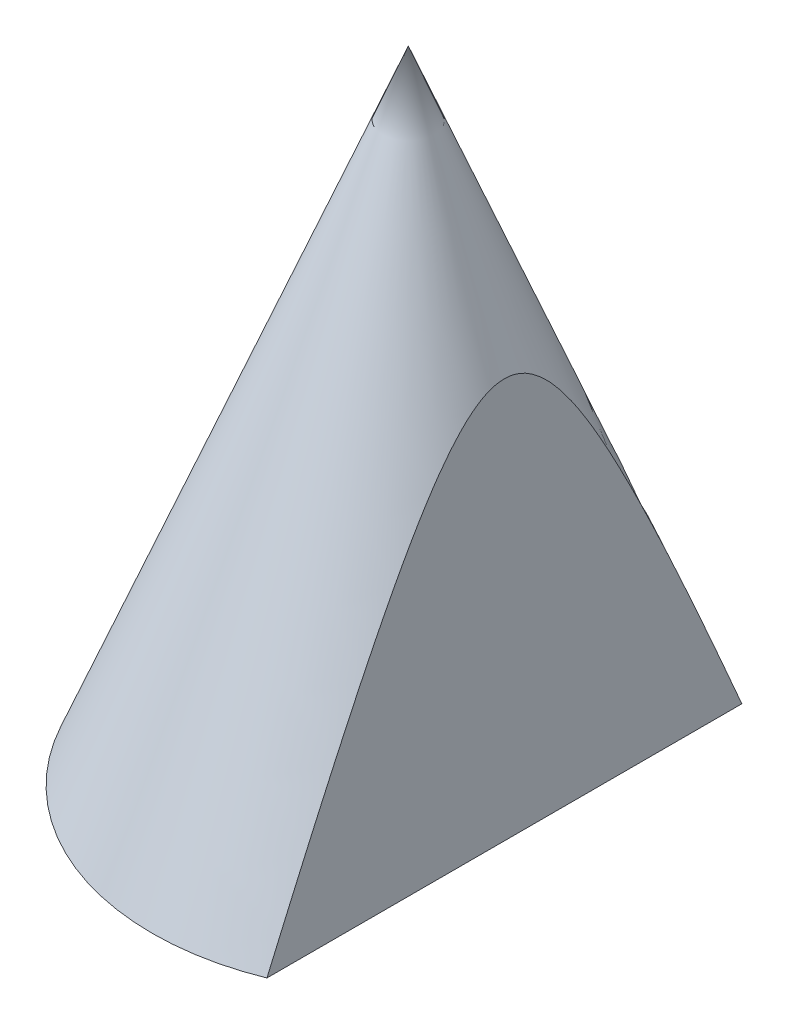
ISO-10303-21;
HEADER;
FILE_DESCRIPTION(('STEP AP214'),'2;1');
FILE_NAME('part.step','',(''),(''),'','','');
FILE_SCHEMA(('AUTOMOTIVE_DESIGN { 1 0 10303 214 1 1 1 1 }'));
ENDSEC;
DATA;
#1=APPLICATION_CONTEXT('core data for automotive mechanical design processes');
#2=APPLICATION_PROTOCOL_DEFINITION('international standard','automotive_design',2000,#1);
#3=PRODUCT_CONTEXT('',#1,'mechanical');
#4=PRODUCT('Part','Part','',(#3));
#5=PRODUCT_RELATED_PRODUCT_CATEGORY('part','',(#4));
#6=PRODUCT_DEFINITION_FORMATION('','',#4);
#7=PRODUCT_DEFINITION_CONTEXT('part definition',#1,'design');
#8=PRODUCT_DEFINITION('design','',#6,#7);
#9=PRODUCT_DEFINITION_SHAPE('','',#8);
#10=(LENGTH_UNIT() NAMED_UNIT(*) SI_UNIT(.MILLI.,.METRE.));
#11=(NAMED_UNIT(*) PLANE_ANGLE_UNIT() SI_UNIT($,.RADIAN.));
#12=(NAMED_UNIT(*) SI_UNIT($,.STERADIAN.) SOLID_ANGLE_UNIT());
#13=UNCERTAINTY_MEASURE_WITH_UNIT(LENGTH_MEASURE(1.E-05),#10,'distance_accuracy_value','');
#14=(GEOMETRIC_REPRESENTATION_CONTEXT(3) GLOBAL_UNCERTAINTY_ASSIGNED_CONTEXT((#13)) GLOBAL_UNIT_ASSIGNED_CONTEXT((#10,
#11,#12)) REPRESENTATION_CONTEXT('',''));
#15=CARTESIAN_POINT('',(0.,0.,0.));
#16=DIRECTION('',(0.,0.,1.));
#17=DIRECTION('',(1.,0.,0.));
#18=AXIS2_PLACEMENT_3D('',#15,#16,#17);
#19=CARTESIAN_POINT('',(5.99999999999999,48.2186316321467,95.4983443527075));
#20=DIRECTION('',(1.,0.,0.));
#21=DIRECTION('',(0.,1.,0.));
#22=AXIS2_PLACEMENT_3D('',#19,#20,#21);
#23=PLANE('',#22);
#24=DIRECTION('',(0.,0.,1.));
#25=VECTOR('',#24,1.);
#26=CARTESIAN_POINT('',(6.,0.,0.));
#27=LINE('',#26,#25);
#28=CARTESIAN_POINT('',(6.,0.,-14.8323969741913));
#29=VERTEX_POINT('',#28);
#30=CARTESIAN_POINT('',(6.,0.,14.8323969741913));
#31=VERTEX_POINT('',#30);
#32=EDGE_CURVE('E63',#29,#31,#27,.T.);
#33=ORIENTED_EDGE('',*,*,#32,.F.);
#34=CARTESIAN_POINT('',(6.,-16.6395559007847,-21.8468827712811));
#35=CARTESIAN_POINT('',(6.,-15.8190797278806,-21.5065335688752));
#36=CARTESIAN_POINT('',(6.,-14.9987962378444,-21.1657191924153));
#37=CARTESIAN_POINT('',(6.,-13.358684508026,-20.4829900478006));
#38=CARTESIAN_POINT('',(6.,-12.5388562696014,-20.1410752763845));
#39=CARTESIAN_POINT('',(6.,-10.898925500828,-19.4556411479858));
#40=CARTESIAN_POINT('',(6.,-10.0788234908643,-19.1121205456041));
#41=CARTESIAN_POINT('',(6.,-8.43924648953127,-18.4235906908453));
#42=CARTESIAN_POINT('',(6.,-7.61977149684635,-18.0785814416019));
#43=CARTESIAN_POINT('',(6.,-5.96872393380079,-17.381382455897));
#44=CARTESIAN_POINT('',(6.,-5.1371630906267,-17.029164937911));
#45=CARTESIAN_POINT('',(6.,-3.47496452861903,-16.3225586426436));
#46=CARTESIAN_POINT('',(6.,-2.64432680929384,-15.9681698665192));
#47=CARTESIAN_POINT('',(6.,-0.98495981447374,-15.2570957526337));
#48=CARTESIAN_POINT('',(6.,-0.156229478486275,-14.9004128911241));
#49=CARTESIAN_POINT('',(6.,1.49981828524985,-14.1838261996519));
#50=CARTESIAN_POINT('',(6.,2.32713574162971,-13.8239224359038));
#51=CARTESIAN_POINT('',(6.,3.9786271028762,-13.1006851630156));
#52=CARTESIAN_POINT('',(6.,4.80280394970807,-12.7373583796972));
#53=CARTESIAN_POINT('',(6.,6.44894475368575,-12.0055502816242));
#54=CARTESIAN_POINT('',(6.,7.27090853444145,-11.6370685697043));
#55=CARTESIAN_POINT('',(6.,8.91418994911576,-10.8923492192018));
#56=CARTESIAN_POINT('',(6.,9.73549884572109,-10.5160922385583));
#57=CARTESIAN_POINT('',(6.,10.9641862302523,-9.94494257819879));
#58=CARTESIAN_POINT('',(6.,11.3731489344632,-9.75345771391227));
#59=CARTESIAN_POINT('',(6.,12.1898035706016,-9.36779885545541));
#60=CARTESIAN_POINT('',(6.,12.5974955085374,-9.17362487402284));
#61=CARTESIAN_POINT('',(6.,13.4086343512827,-8.78338162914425));
#62=CARTESIAN_POINT('',(6.,13.8120914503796,-8.58733357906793));
#63=CARTESIAN_POINT('',(6.,14.6171345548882,-8.19143743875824));
#64=CARTESIAN_POINT('',(6.,15.0187205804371,-7.99158938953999));
#65=CARTESIAN_POINT('',(6.,15.8199859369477,-7.58702557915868));
#66=CARTESIAN_POINT('',(6.,16.2196627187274,-7.38230475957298));
#67=CARTESIAN_POINT('',(6.,17.015978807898,-6.96707974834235));
#68=CARTESIAN_POINT('',(6.,17.4126183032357,-6.75657591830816));
#69=CARTESIAN_POINT('',(6.,18.1998092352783,-6.32933462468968));
#70=CARTESIAN_POINT('',(5.99999999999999,18.590381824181,-6.11263623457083));
#71=CARTESIAN_POINT('',(5.99999999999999,19.3662570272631,-5.6696841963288));
#72=CARTESIAN_POINT('',(5.99999999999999,19.7515582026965,-5.44342800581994));
#73=CARTESIAN_POINT('',(5.99999999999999,20.3232957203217,-5.0946293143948));
#74=CARTESIAN_POINT('',(5.99999999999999,20.5126711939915,-4.9769044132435));
#75=CARTESIAN_POINT('',(5.99999999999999,20.8890084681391,-4.73766471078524));
#76=CARTESIAN_POINT('',(5.99999999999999,21.0759703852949,-4.61615009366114));
#77=CARTESIAN_POINT('',(5.99999999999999,21.4467958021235,-4.36866424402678));
#78=CARTESIAN_POINT('',(5.99999999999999,21.630660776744,-4.24269522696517));
#79=CARTESIAN_POINT('',(5.99999999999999,21.9945328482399,-3.98532070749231));
#80=CARTESIAN_POINT('',(5.99999999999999,22.1745405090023,-3.85391600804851));
#81=CARTESIAN_POINT('',(5.99999999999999,22.4423569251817,-3.65057752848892));
#82=CARTESIAN_POINT('',(5.99999999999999,22.5320458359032,-3.58111701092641));
#83=CARTESIAN_POINT('',(5.99999999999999,22.7098987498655,-3.44024942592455));
#84=CARTESIAN_POINT('',(5.99999999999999,22.7980626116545,-3.36884217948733));
#85=CARTESIAN_POINT('',(5.99999999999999,22.9726717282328,-3.22379162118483));
#86=CARTESIAN_POINT('',(5.99999999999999,23.0591153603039,-3.15014634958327));
#87=CARTESIAN_POINT('',(5.99999999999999,23.2298537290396,-3.00041271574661));
#88=CARTESIAN_POINT('',(5.99999999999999,23.3141485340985,-2.92432443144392));
#89=CARTESIAN_POINT('',(5.99999999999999,23.5619683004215,-2.69310419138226));
#90=CARTESIAN_POINT('',(5.99999999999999,23.7217682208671,-2.53392213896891));
#91=CARTESIAN_POINT('',(5.99999999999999,24.0264486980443,-2.20194122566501));
#92=CARTESIAN_POINT('',(5.99999999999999,24.1713528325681,-2.02916467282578));
#93=CARTESIAN_POINT('',(5.99999999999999,24.3547547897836,-1.77987928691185));
#94=CARTESIAN_POINT('',(5.99999999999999,24.4031711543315,-1.71066549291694));
#95=CARTESIAN_POINT('',(5.99999999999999,24.4961100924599,-1.56969319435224));
#96=CARTESIAN_POINT('',(5.99999999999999,24.5406328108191,-1.49793478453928));
#97=CARTESIAN_POINT('',(5.99999999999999,24.6674148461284,-1.27841742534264));
#98=CARTESIAN_POINT('',(5.99999999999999,24.742840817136,-1.12647850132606));
#99=CARTESIAN_POINT('',(5.99999999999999,24.8372661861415,-0.889701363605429));
#100=CARTESIAN_POINT('',(5.99999999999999,24.8657747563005,-0.808604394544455));
#101=CARTESIAN_POINT('',(5.99999999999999,24.9151838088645,-0.644142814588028));
#102=CARTESIAN_POINT('',(5.99999999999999,24.9360893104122,-0.560779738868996));
#103=CARTESIAN_POINT('',(5.99999999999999,24.9693889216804,-0.392550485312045));
#104=CARTESIAN_POINT('',(5.99999999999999,24.9818021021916,-0.307688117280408));
#105=CARTESIAN_POINT('',(5.99999999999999,24.9975945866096,-0.13712612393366));
#106=CARTESIAN_POINT('',(5.99999999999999,25.0009755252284,-0.0514266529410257));
#107=CARTESIAN_POINT('',(5.99999999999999,24.9987077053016,0.107846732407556));
#108=CARTESIAN_POINT('',(5.99999999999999,24.9942558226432,0.18144000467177));
#109=CARTESIAN_POINT('',(5.99999999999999,24.9787289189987,0.327935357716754));
#110=CARTESIAN_POINT('',(5.99999999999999,24.9676517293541,0.40083720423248));
#111=CARTESIAN_POINT('',(5.99999999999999,24.9249883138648,0.617804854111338));
#112=CARTESIAN_POINT('',(5.99999999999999,24.8839718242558,0.760061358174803));
#113=CARTESIAN_POINT('',(5.99999999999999,24.7608700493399,1.09273634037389));
#114=CARTESIAN_POINT('',(5.99999999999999,24.6688890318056,1.27940645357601));
#115=CARTESIAN_POINT('',(5.99999999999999,24.5108675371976,1.54715112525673));
#116=CARTESIAN_POINT('',(5.99999999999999,24.4547469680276,1.63448474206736));
#117=CARTESIAN_POINT('',(5.99999999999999,24.337013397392,1.80538086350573));
#118=CARTESIAN_POINT('',(5.99999999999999,24.2754012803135,1.88894397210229));
#119=CARTESIAN_POINT('',(5.99999999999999,24.1256159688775,2.08094894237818));
#120=CARTESIAN_POINT('',(5.99999999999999,24.0356391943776,2.18797331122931));
#121=CARTESIAN_POINT('',(5.99999999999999,23.8495293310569,2.39656419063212));
#122=CARTESIAN_POINT('',(5.99999999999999,23.753393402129,2.49812814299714));
#123=CARTESIAN_POINT('',(5.99999999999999,23.5562010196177,2.69667875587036));
#124=CARTESIAN_POINT('',(5.99999999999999,23.455136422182,2.7936572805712));
#125=CARTESIAN_POINT('',(5.99999999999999,23.24923251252,2.98352608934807));
#126=CARTESIAN_POINT('',(5.99999999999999,23.1443927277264,3.07641585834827));
#127=CARTESIAN_POINT('',(5.99999999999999,22.9309430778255,3.25929679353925));
#128=CARTESIAN_POINT('',(5.99999999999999,22.8223118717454,3.34926295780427));
#129=CARTESIAN_POINT('',(5.99999999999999,22.6025501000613,3.52608628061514));
#130=CARTESIAN_POINT('',(5.99999999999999,22.4914194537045,3.61294333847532));
#131=CARTESIAN_POINT('',(5.99999999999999,22.267226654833,3.78384541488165));
#132=CARTESIAN_POINT('',(5.99999999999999,22.1541669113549,3.86789360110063));
#133=CARTESIAN_POINT('',(5.99999999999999,21.9263268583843,4.03360932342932));
#134=CARTESIAN_POINT('',(5.99999999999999,21.8115466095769,4.11527694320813));
#135=CARTESIAN_POINT('',(5.99999999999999,21.4404455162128,4.37430963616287));
#136=CARTESIAN_POINT('',(5.99999999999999,21.1812883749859,4.54761619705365));
#137=CARTESIAN_POINT('',(5.99999999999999,20.6578672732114,4.8863652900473));
#138=CARTESIAN_POINT('',(5.99999999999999,20.3936024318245,5.05180644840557));
#139=CARTESIAN_POINT('',(5.99999999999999,19.8611212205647,5.37651646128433));
#140=CARTESIAN_POINT('',(5.99999999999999,19.5929027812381,5.53578191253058));
#141=CARTESIAN_POINT('',(5.99999999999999,19.0535207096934,5.84924889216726));
#142=CARTESIAN_POINT('',(5.99999999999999,18.7823569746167,6.0034502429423));
#143=CARTESIAN_POINT('',(5.99999999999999,18.2370988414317,6.30802199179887));
#144=CARTESIAN_POINT('',(6.,17.9629992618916,6.45838309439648));
#145=CARTESIAN_POINT('',(6.,17.4129090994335,6.75560679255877));
#146=CARTESIAN_POINT('',(6.,17.1369184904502,6.90246933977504));
#147=CARTESIAN_POINT('',(6.,16.3068202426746,7.3385526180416));
#148=CARTESIAN_POINT('',(6.,15.7504002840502,7.62337173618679));
#149=CARTESIAN_POINT('',(6.,14.6334515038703,8.18428293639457));
#150=CARTESIAN_POINT('',(6.,14.0729242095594,8.46037807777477));
#151=CARTESIAN_POINT('',(6.,12.9486354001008,9.00600172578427));
#152=CARTESIAN_POINT('',(6.,12.3848736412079,9.2755297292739));
#153=CARTESIAN_POINT('',(6.,11.2556979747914,9.80906161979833));
#154=CARTESIAN_POINT('',(6.,10.6902874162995,10.073072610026));
#155=CARTESIAN_POINT('',(6.,9.55758155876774,10.5969720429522));
#156=CARTESIAN_POINT('',(6.,8.99028631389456,10.8568606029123));
#157=CARTESIAN_POINT('',(6.,7.8527661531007,11.3739289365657));
#158=CARTESIAN_POINT('',(6.,7.28253746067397,11.6311003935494));
#159=CARTESIAN_POINT('',(6.,6.14083192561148,12.1426590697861));
#160=CARTESIAN_POINT('',(6.,5.56935507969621,12.3970462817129));
#161=CARTESIAN_POINT('',(6.,3.85337530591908,13.1567432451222));
#162=CARTESIAN_POINT('',(6.,2.70733601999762,13.6585824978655));
#163=CARTESIAN_POINT('',(6.,0.412308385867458,14.6556233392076));
#164=CARTESIAN_POINT('',(6.,-0.736680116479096,15.1508245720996));
#165=CARTESIAN_POINT('',(6.,-3.03680223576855,16.1362241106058));
#166=CARTESIAN_POINT('',(6.,-4.18793585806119,16.6264224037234));
#167=CARTESIAN_POINT('',(6.,-6.49275821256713,17.6033617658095));
#168=CARTESIAN_POINT('',(6.,-7.64644825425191,18.0900997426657));
#169=CARTESIAN_POINT('',(6.,-9.95510516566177,19.0605411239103));
#170=CARTESIAN_POINT('',(6.,-11.1100720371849,19.5442445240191));
#171=CARTESIAN_POINT('',(6.,-13.4209849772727,20.5092035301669));
#172=CARTESIAN_POINT('',(6.,-14.576931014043,20.9904592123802));
#173=CARTESIAN_POINT('',(6.,-16.8896475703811,21.950985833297));
#174=CARTESIAN_POINT('',(6.,-18.0464180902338,22.4302567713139));
#175=CARTESIAN_POINT('',(6.,-21.4665295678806,23.8444538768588));
#176=CARTESIAN_POINT('',(6.,-23.7308208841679,24.7770815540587));
#177=CARTESIAN_POINT('',(6.,-28.2612341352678,26.637939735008));
#178=CARTESIAN_POINT('',(6.,-30.5273560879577,27.5661701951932));
#179=CARTESIAN_POINT('',(6.,-35.0586162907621,29.4184247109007));
#180=CARTESIAN_POINT('',(6.00000000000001,-37.3237531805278,30.3424520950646));
#181=CARTESIAN_POINT('',(6.00000000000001,-40.7222001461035,31.726633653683));
#182=CARTESIAN_POINT('',(6.00000000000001,-41.8551328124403,32.187714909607));
#183=CARTESIAN_POINT('',(6.00000000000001,-44.1212208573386,33.1093294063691));
#184=CARTESIAN_POINT('',(6.00000000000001,-45.2543762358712,33.5698626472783));
#185=CARTESIAN_POINT('',(6.00000000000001,-46.387628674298,34.0301569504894));
#186=B_SPLINE_CURVE_WITH_KNOTS('',3,(#34,#35,#36,#37,#38,#39,#40,#41,#42,#43,#44,#45,#46,#47,
#48,#49,#50,#51,#52,#53,#54,#55,#56,#57,#58,#59,#60,#61,#62,#63,#64,#65,#66,#67,#68,#69,#70,#71,
#72,#73,#74,#75,#76,#77,#78,#79,#80,#81,#82,#83,#84,#85,#86,#87,#88,#89,#90,#91,#92,#93,#94,#95,
#96,#97,#98,#99,#100,#101,#102,#103,#104,#105,#106,#107,#108,#109,#110,#111,#112,#113,#114,#115,
#116,#117,#118,#119,#120,#121,#122,#123,#124,#125,#126,#127,#128,#129,#130,#131,#132,#133,#134,
#135,#136,#137,#138,#139,#140,#141,#142,#143,#144,#145,#146,#147,#148,#149,#150,#151,#152,#153,
#154,#155,#156,#157,#158,#159,#160,#161,#162,#163,#164,#165,#166,#167,#168,#169,#170,#171,#172,
#173,#174,#175,#176,#177,#178,#179,#180,#181,#182,#183,#184,#185),.UNSPECIFIED.,.F.,.F.,(4,2,2,
2,2,2,2,2,2,2,2,2,2,2,2,2,2,2,2,2,2,2,2,2,2,2,2,2,2,2,2,2,2,2,2,2,2,2,2,2,2,2,2,2,2,2,2,2,2,2,2,
2,2,2,2,2,2,2,2,2,2,2,2,2,2,2,2,2,2,2,2,2,2,2,2,4),(0.,2.66480203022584,5.32961196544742,
7.99703706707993,10.6644565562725,13.3736892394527,16.0829204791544,18.7896010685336,
21.4962261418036,24.198334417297,26.900652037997,29.6107817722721,30.9654890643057,
32.3201899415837,33.6658751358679,35.0115458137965,36.3586802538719,37.7057306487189,
39.0456222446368,40.385872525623,41.0547922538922,41.7236795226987,42.392238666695,
43.0606994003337,43.401000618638,43.7413332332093,44.081972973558,44.4226018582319,
45.0986788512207,45.7736686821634,46.0269505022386,46.2802229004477,46.7870006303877,
47.0445923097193,47.3020136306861,47.5588549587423,47.8156497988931,48.036525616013,
48.2574737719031,48.6995812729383,49.3202158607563,49.6315228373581,49.9427797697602,
50.3619362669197,50.7812874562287,51.2013567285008,51.6214787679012,52.0445576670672,
52.4676502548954,52.890248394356,53.312831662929,54.24791071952,55.1831524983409,
56.1189025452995,57.0546853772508,57.9925520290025,58.9304316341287,60.8055537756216,
62.6800108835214,64.5546111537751,66.4266271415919,68.298589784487,70.175195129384,
72.0518054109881,75.805068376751,79.5585316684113,83.3120043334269,87.0684909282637,
90.8249828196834,94.5813570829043,98.3377326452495,105.684240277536,113.030820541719,
120.369895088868,124.039389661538,127.708883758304),.UNSPECIFIED.);
#187=EDGE_CURVE('E11',#31,#29,#186,.F.);
#188=ORIENTED_EDGE('',*,*,#187,.F.);
#189=EDGE_LOOP('',(#33,#188));
#190=FACE_BOUND('',#189,.T.);
#191=ADVANCED_FACE('F43',(#190),#23,.T.);
#192=CARTESIAN_POINT('',(0.,0.,0.));
#193=DIRECTION('',(0.,-1.,0.));
#194=DIRECTION('',(0.,0.,-1.));
#195=AXIS2_PLACEMENT_3D('',#192,#193,#194);
#196=PLANE('',#195);
#197=CARTESIAN_POINT('',(0.,0.,0.));
#198=DIRECTION('',(0.,1.,0.));
#199=DIRECTION('',(0.,0.,1.));
#200=AXIS2_PLACEMENT_3D('',#197,#198,#199);
#201=CIRCLE('',#200,16.);
#202=EDGE_CURVE('E57',#29,#31,#201,.T.);
#203=ORIENTED_EDGE('',*,*,#202,.F.);
#204=ORIENTED_EDGE('',*,*,#32,.T.);
#205=EDGE_LOOP('',(#203,#204));
#206=FACE_BOUND('',#205,.T.);
#207=ADVANCED_FACE('F45',(#206),#196,.T.);
#208=CARTESIAN_POINT('',(0.,40.,0.));
#209=DIRECTION('',(0.,-1.,0.));
#210=DIRECTION('',(0.,0.,-1.));
#211=AXIS2_PLACEMENT_3D('',#208,#209,#210);
#212=CONICAL_SURFACE('',#211,0.,0.380506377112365);
#213=CARTESIAN_POINT('',(0.,40.,0.));
#214=VERTEX_POINT('',#213);
#215=VERTEX_LOOP('',#214);
#216=FACE_BOUND('',#215,.T.);
#217=ORIENTED_EDGE('',*,*,#202,.T.);
#218=ORIENTED_EDGE('',*,*,#187,.T.);
#219=EDGE_LOOP('',(#217,#218));
#220=FACE_BOUND('',#219,.T.);
#221=ADVANCED_FACE('F74',(#216,#220),#212,.T.);
#222=CLOSED_SHELL('',(#191,#207,#221));
#223=MANIFOLD_SOLID_BREP('B2',#222);
#224=ADVANCED_BREP_SHAPE_REPRESENTATION('',(#18,#223),#14);
#225=SHAPE_DEFINITION_REPRESENTATION(#9,#224);
ENDSEC;
END-ISO-10303-21;
